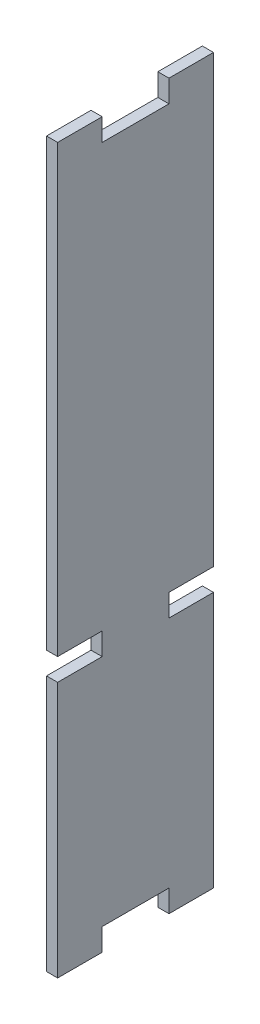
from build123d import *

# Parameters (mm, degrees)
EXTRUDE1_DEPTH = 3.175


with BuildPart() as part:
    # Sketch1 → Extrude1 (new body)
    with BuildSketch(Plane(origin=(0, 0, 0), x_dir=(0, 0, -1), z_dir=(1, 0, 0))):
        Polygon((-9.525, 0), (9.525, 0), (9.525, -6.35), (22.225, -6.35), (22.225, 66.675), (9.525, 66.675), (9.525, 73.025), (22.225, 73.025), (22.225, 200.025), (9.525, 200.025), (9.525, 193.675), (-9.525, 193.675), (-9.525, 200.025), (-22.225, 200.025), (-22.225, 73.025), (-9.525, 73.025), (-9.525, 66.675), (-22.225, 66.675), (-22.225, -6.35), (-9.525, -6.35), align=None)
    extrude(amount=EXTRUDE1_DEPTH)


solid = part.part
